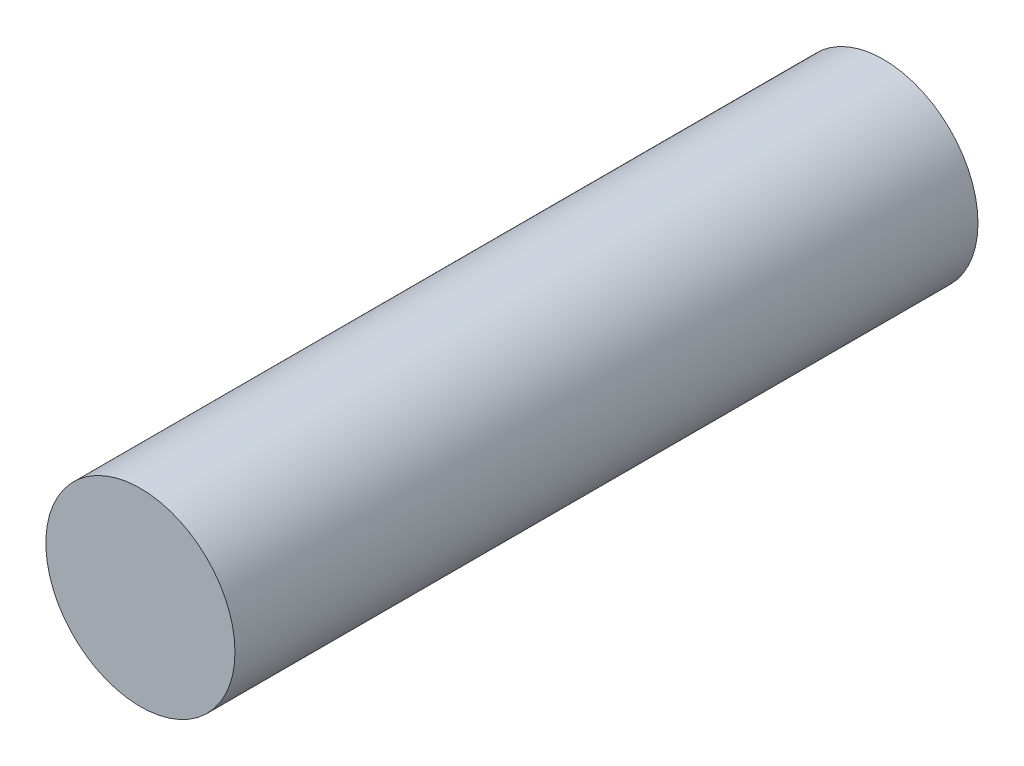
ISO-10303-21;
HEADER;
FILE_DESCRIPTION(('STEP AP214'),'2;1');
FILE_NAME('part.step','',(''),(''),'','','');
FILE_SCHEMA(('AUTOMOTIVE_DESIGN { 1 0 10303 214 1 1 1 1 }'));
ENDSEC;
DATA;
#1=APPLICATION_CONTEXT('core data for automotive mechanical design processes');
#2=APPLICATION_PROTOCOL_DEFINITION('international standard','automotive_design',2000,#1);
#3=PRODUCT_CONTEXT('',#1,'mechanical');
#4=PRODUCT('Part','Part','',(#3));
#5=PRODUCT_RELATED_PRODUCT_CATEGORY('part','',(#4));
#6=PRODUCT_DEFINITION_FORMATION('','',#4);
#7=PRODUCT_DEFINITION_CONTEXT('part definition',#1,'design');
#8=PRODUCT_DEFINITION('design','',#6,#7);
#9=PRODUCT_DEFINITION_SHAPE('','',#8);
#10=(LENGTH_UNIT() NAMED_UNIT(*) SI_UNIT(.MILLI.,.METRE.));
#11=(NAMED_UNIT(*) PLANE_ANGLE_UNIT() SI_UNIT($,.RADIAN.));
#12=(NAMED_UNIT(*) SI_UNIT($,.STERADIAN.) SOLID_ANGLE_UNIT());
#13=UNCERTAINTY_MEASURE_WITH_UNIT(LENGTH_MEASURE(1.E-05),#10,'distance_accuracy_value','');
#14=(GEOMETRIC_REPRESENTATION_CONTEXT(3) GLOBAL_UNCERTAINTY_ASSIGNED_CONTEXT((#13)) GLOBAL_UNIT_ASSIGNED_CONTEXT((#10,
#11,#12)) REPRESENTATION_CONTEXT('',''));
#15=CARTESIAN_POINT('',(0.,0.,0.));
#16=DIRECTION('',(0.,0.,1.));
#17=DIRECTION('',(1.,0.,0.));
#18=AXIS2_PLACEMENT_3D('',#15,#16,#17);
#19=CARTESIAN_POINT('',(0.,0.,11.));
#20=DIRECTION('',(0.,0.,-1.));
#21=DIRECTION('',(-1.,0.,0.));
#22=AXIS2_PLACEMENT_3D('',#19,#20,#21);
#23=CYLINDRICAL_SURFACE('',#22,1.4);
#24=CARTESIAN_POINT('',(0.,0.,11.));
#25=DIRECTION('',(0.,0.,1.));
#26=DIRECTION('',(1.,0.,0.));
#27=AXIS2_PLACEMENT_3D('',#24,#25,#26);
#28=CIRCLE('',#27,1.4);
#29=CARTESIAN_POINT('',(1.4,0.,11.));
#30=VERTEX_POINT('',#29);
#31=EDGE_CURVE('E10',#30,#30,#28,.T.);
#32=ORIENTED_EDGE('',*,*,#31,.F.);
#33=EDGE_LOOP('',(#32));
#34=FACE_BOUND('',#33,.T.);
#35=CARTESIAN_POINT('',(0.,0.,0.));
#36=DIRECTION('',(0.,0.,1.));
#37=DIRECTION('',(1.,0.,0.));
#38=AXIS2_PLACEMENT_3D('',#35,#36,#37);
#39=CIRCLE('',#38,1.4);
#40=CARTESIAN_POINT('',(1.4,0.,0.));
#41=VERTEX_POINT('',#40);
#42=EDGE_CURVE('E46',#41,#41,#39,.T.);
#43=ORIENTED_EDGE('',*,*,#42,.T.);
#44=EDGE_LOOP('',(#43));
#45=FACE_BOUND('',#44,.T.);
#46=ADVANCED_FACE('F43',(#34,#45),#23,.T.);
#47=CARTESIAN_POINT('',(0.,0.,11.));
#48=DIRECTION('',(0.,0.,1.));
#49=DIRECTION('',(1.,0.,0.));
#50=AXIS2_PLACEMENT_3D('',#47,#48,#49);
#51=PLANE('',#50);
#52=ORIENTED_EDGE('',*,*,#31,.T.);
#53=EDGE_LOOP('',(#52));
#54=FACE_BOUND('',#53,.T.);
#55=ADVANCED_FACE('F60',(#54),#51,.T.);
#56=CARTESIAN_POINT('',(0.,0.,0.));
#57=DIRECTION('',(0.,0.,1.));
#58=DIRECTION('',(1.,0.,0.));
#59=AXIS2_PLACEMENT_3D('',#56,#57,#58);
#60=PLANE('',#59);
#61=ORIENTED_EDGE('',*,*,#42,.F.);
#62=EDGE_LOOP('',(#61));
#63=FACE_BOUND('',#62,.T.);
#64=ADVANCED_FACE('F58',(#63),#60,.F.);
#65=CLOSED_SHELL('',(#46,#55,#64));
#66=MANIFOLD_SOLID_BREP('B2',#65);
#67=ADVANCED_BREP_SHAPE_REPRESENTATION('',(#18,#66),#14);
#68=SHAPE_DEFINITION_REPRESENTATION(#9,#67);
ENDSEC;
END-ISO-10303-21;
